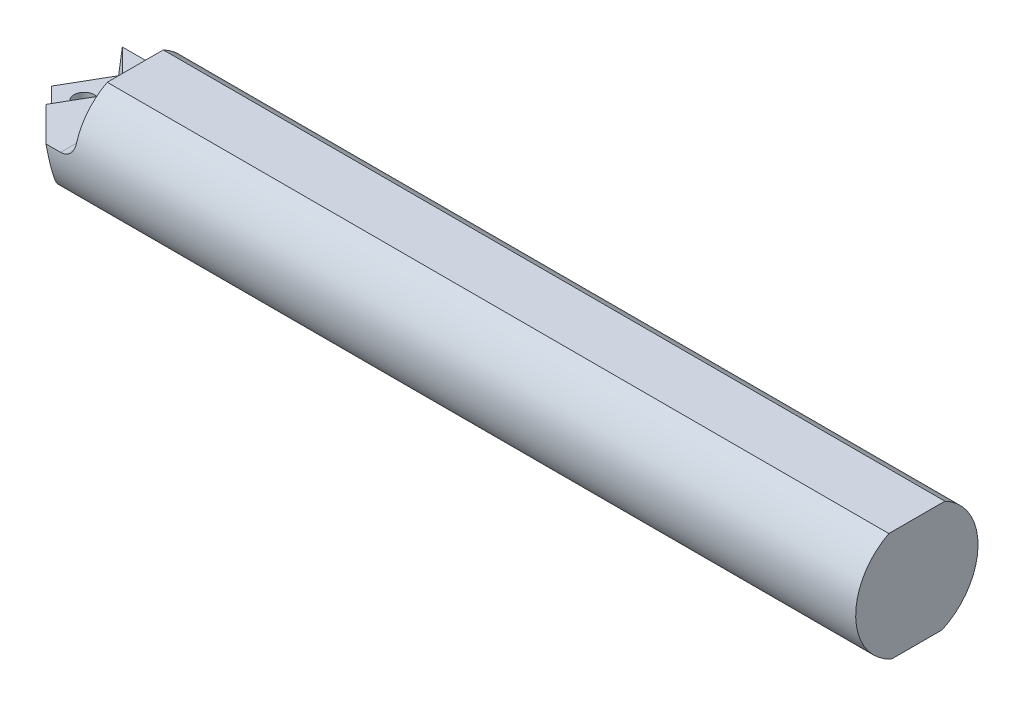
from build123d import *

# Parameters (mm, degrees)
SKETCH1_R           = 9
BOSS_EXTRUDE1_DEPTH = 65
SKETCH2_W           = 130
SKETCH2_H           = 18
CUT_EXTRUDE1_DEPTH  = 68.78642932
SKETCH3_W           = 18
SKETCH3_H           = 7.5
CUT_EXTRUDE2_DEPTH  = 15
CUT_EXTRUDE3_DEPTH  = 3.18
CUT_EXTRUDE3_DRAFT  = -7
SKETCH8_W           = 130
SKETCH8_H           = 18
CUT_EXTRUDE6_DEPTH  = 68.590235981
SKETCH5_R           = 1.5
CUT_EXTRUDE4_DEPTH  = 67.483549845
CUT_EXTRUDE5_DEPTH  = 67.19433523
CUT_EXTRUDE5_TAPER  = -10
FILLET1_R           = 2
SKETCH9_R           = 1.5
CUT_EXTRUDE7_DEPTH  = 3.18


with BuildPart() as part:
    # Sketch1 → Boss-Extrude1 (new, symmetric)
    with BuildSketch(Plane(origin=(0, 0, 0), x_dir=(0, 0, -1), z_dir=(1, 0, 0))):
        Circle(SKETCH1_R)
    extrude(amount=BOSS_EXTRUDE1_DEPTH, both=True)

    # Sketch2 → Cut-Extrude1 (cut, through all)
    with BuildSketch(Plane(origin=(0, 8, 0), x_dir=(1, 0, 0), z_dir=(0, 1, 0))):
        Rectangle(SKETCH2_W, SKETCH2_H)
    extrude(amount=CUT_EXTRUDE1_DEPTH, mode=Mode.SUBTRACT)

    # Sketch3 → Cut-Extrude2 (cut)
    with BuildSketch(Plane.ZY.offset(65)):
        with Locations((0, 4.25)):
            Rectangle(SKETCH3_W, SKETCH3_H)
    extrude(amount=-CUT_EXTRUDE2_DEPTH, mode=Mode.SUBTRACT)


with BuildPart() as cut_extrude3_tool:
    # Sketch4 → Cut-Extrude3 (with draft: the straight prism first)
    with BuildSketch(Plane(origin=(0, 0.5, 0), x_dir=(1, 0, 0), z_dir=(0, 1, 0))):
        Polygon((-65, 1.867291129), (-59.187516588, -3.945192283), (-55.077470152, 3.173616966), (-60.889953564, 8.986100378), align=None)
    extrude(amount=-CUT_EXTRUDE3_DEPTH)
    # Cut-Extrude3: the draft: its side faces are tilted about the plane it starts from
    cut_extrude3_sides = [cut_extrude3_tool.faces().sort_by_distance(p)[0] for p in [
        (-62.093758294, -1.09, 1.038950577),
        (-57.13249337, -1.09, 0.385787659),
        (-57.983711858, -1.09, -6.079858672),
        (-62.944976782, -1.09, -5.426695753),
    ]]
    draft(cut_extrude3_sides, Plane(origin=(0, 0.5, 0), x_dir=(1, 0, 0), z_dir=(0, 1, 0)), CUT_EXTRUDE3_DRAFT)


with BuildPart() as part_1:
    add(part.part)

    # Cut-Extrude3: cut by cut_extrude3_tool
    add(cut_extrude3_tool.part, mode=Mode.SUBTRACT)

    # Sketch8 → Cut-Extrude6 (cut, through all)
    with BuildSketch(Plane(origin=(0, -8.2, 0), x_dir=(1, 0, 0), z_dir=(0, 1, 0))):
        Rectangle(SKETCH8_W, SKETCH8_H)
    extrude(amount=-CUT_EXTRUDE6_DEPTH, mode=Mode.SUBTRACT)

    # Sketch5 → Cut-Extrude4 (cut, through all)
    with BuildSketch(Plane(origin=(0, -2.68, 0), x_dir=(1, 0, 0), z_dir=(0, 1, 0))):
        with Locations(Location((-60.038735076, 2.520454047, 0), (0, 0, 270))):
            Circle(SKETCH5_R)
    extrude(amount=-CUT_EXTRUDE4_DEPTH, mode=Mode.SUBTRACT)

    # Sketch6 → Cut-Extrude5 (cut, through all)
    with BuildSketch(Plane(origin=(0, 0.5, 0), x_dir=(1, 0, 0), z_dir=(0, 1, 0))):
        Polygon((-65, -8.986100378), (-54.146608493, -8.986100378), (-59.187516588, -3.945192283), (-65, 1.867291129), align=None)
        Polygon((-65, 8.986100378), (-65, 1.867291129), (-60.889953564, 8.986100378), align=None)
    extrude(amount=-CUT_EXTRUDE5_DEPTH, taper=CUT_EXTRUDE5_TAPER, mode=Mode.SUBTRACT)

    # Fillet1
    fillet1_edges = [part_1.edges().sort_by_distance(p)[0] for p in [
        (-50, 0.5, 0),
    ]]
    fillet(fillet1_edges, radius=FILLET1_R)

    # Sketch9 → Cut-Extrude7 (cut)
    with BuildSketch(Plane(origin=(0, 0.5, 0), x_dir=(1, 0, 0), z_dir=(0, 1, 0))):
        with Locations((-55.077470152, 3.173616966)):
            Circle(SKETCH9_R)
    extrude(amount=-CUT_EXTRUDE7_DEPTH, mode=Mode.SUBTRACT)


solid = part_1.part
